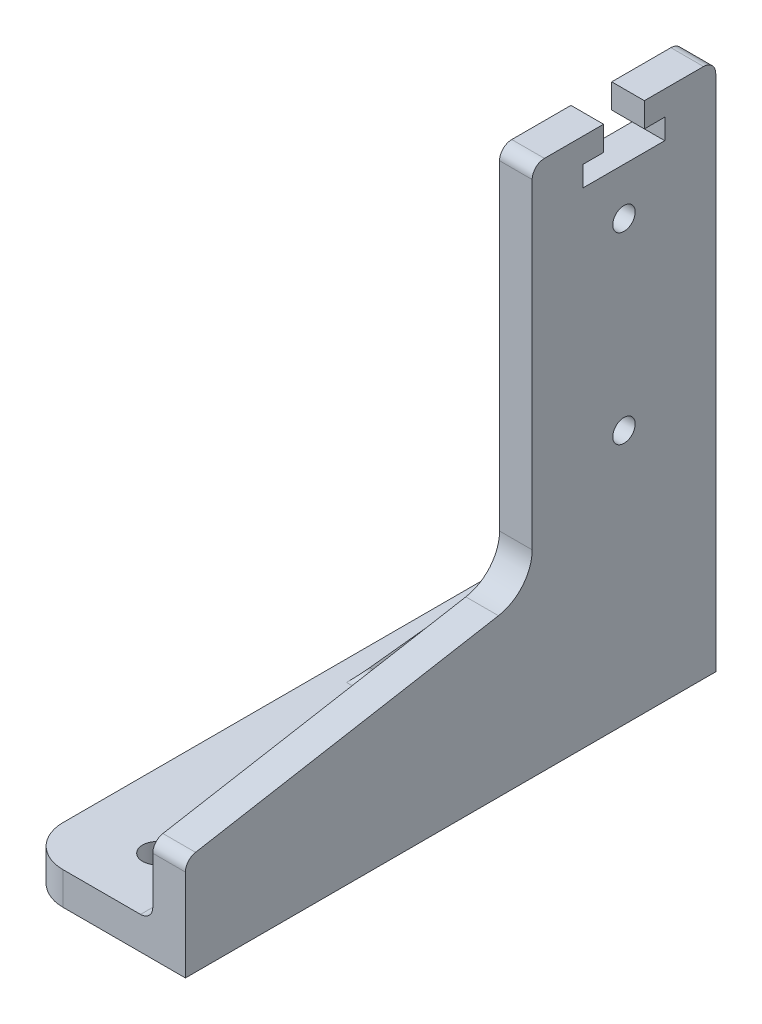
ISO-10303-21;
HEADER;
FILE_DESCRIPTION(('STEP AP214'),'2;1');
FILE_NAME('part.step','',(''),(''),'','','');
FILE_SCHEMA(('AUTOMOTIVE_DESIGN { 1 0 10303 214 1 1 1 1 }'));
ENDSEC;
DATA;
#1=APPLICATION_CONTEXT('core data for automotive mechanical design processes');
#2=APPLICATION_PROTOCOL_DEFINITION('international standard','automotive_design',2000,#1);
#3=PRODUCT_CONTEXT('',#1,'mechanical');
#4=PRODUCT('Part','Part','',(#3));
#5=PRODUCT_RELATED_PRODUCT_CATEGORY('part','',(#4));
#6=PRODUCT_DEFINITION_FORMATION('','',#4);
#7=PRODUCT_DEFINITION_CONTEXT('part definition',#1,'design');
#8=PRODUCT_DEFINITION('design','',#6,#7);
#9=PRODUCT_DEFINITION_SHAPE('','',#8);
#10=(LENGTH_UNIT() NAMED_UNIT(*) SI_UNIT(.MILLI.,.METRE.));
#11=(NAMED_UNIT(*) PLANE_ANGLE_UNIT() SI_UNIT($,.RADIAN.));
#12=(NAMED_UNIT(*) SI_UNIT($,.STERADIAN.) SOLID_ANGLE_UNIT());
#13=UNCERTAINTY_MEASURE_WITH_UNIT(LENGTH_MEASURE(1.E-05),#10,'distance_accuracy_value','');
#14=(GEOMETRIC_REPRESENTATION_CONTEXT(3) GLOBAL_UNCERTAINTY_ASSIGNED_CONTEXT((#13)) GLOBAL_UNIT_ASSIGNED_CONTEXT((#10,
#11,#12)) REPRESENTATION_CONTEXT('',''));
#15=CARTESIAN_POINT('',(0.,0.,0.));
#16=DIRECTION('',(0.,0.,1.));
#17=DIRECTION('',(1.,0.,0.));
#18=AXIS2_PLACEMENT_3D('',#15,#16,#17);
#19=CARTESIAN_POINT('',(0.,130.,65.));
#20=DIRECTION('',(0.,-1.,0.));
#21=DIRECTION('',(0.,0.,-1.));
#22=AXIS2_PLACEMENT_3D('',#19,#20,#21);
#23=PLANE('',#22);
#24=DIRECTION('',(0.,0.,-1.));
#25=VECTOR('',#24,1.);
#26=CARTESIAN_POINT('',(0.,130.,65.));
#27=LINE('',#26,#25);
#28=CARTESIAN_POINT('',(0.,130.,-47.5));
#29=VERTEX_POINT('',#28);
#30=CARTESIAN_POINT('',(0.,130.,-62.));
#31=VERTEX_POINT('',#30);
#32=EDGE_CURVE('E374',#29,#31,#27,.T.);
#33=ORIENTED_EDGE('',*,*,#32,.T.);
#34=DIRECTION('',(-1.,0.,0.));
#35=VECTOR('',#34,1.);
#36=CARTESIAN_POINT('',(0.,130.,-62.));
#37=LINE('',#36,#35);
#38=CARTESIAN_POINT('',(-8.,130.,-62.));
#39=VERTEX_POINT('',#38);
#40=EDGE_CURVE('E444',#31,#39,#37,.T.);
#41=ORIENTED_EDGE('',*,*,#40,.T.);
#42=DIRECTION('',(0.,0.,-1.));
#43=VECTOR('',#42,1.);
#44=CARTESIAN_POINT('',(-8.,130.,65.));
#45=LINE('',#44,#43);
#46=CARTESIAN_POINT('',(-8.,130.,-47.5));
#47=VERTEX_POINT('',#46);
#48=EDGE_CURVE('E371',#47,#39,#45,.T.);
#49=ORIENTED_EDGE('',*,*,#48,.F.);
#50=DIRECTION('',(-1.,0.,0.));
#51=VECTOR('',#50,1.);
#52=CARTESIAN_POINT('',(0.,130.,-47.5));
#53=LINE('',#52,#51);
#54=EDGE_CURVE('E310',#29,#47,#53,.T.);
#55=ORIENTED_EDGE('',*,*,#54,.F.);
#56=EDGE_LOOP('',(#33,#41,#49,#55));
#57=FACE_BOUND('',#56,.T.);
#58=ADVANCED_FACE('F41',(#57),#23,.F.);
#59=CARTESIAN_POINT('',(-40.,0.,65.));
#60=DIRECTION('',(0.,1.,0.));
#61=DIRECTION('',(0.,0.,1.));
#62=AXIS2_PLACEMENT_3D('',#59,#60,#61);
#63=PLANE('',#62);
#64=CARTESIAN_POINT('',(-22.,0.,50.));
#65=DIRECTION('',(0.,1.,0.));
#66=DIRECTION('',(-1.,0.,0.));
#67=AXIS2_PLACEMENT_3D('',#64,#65,#66);
#68=CIRCLE('',#67,3.5);
#69=CARTESIAN_POINT('',(-25.5,0.,50.));
#70=VERTEX_POINT('',#69);
#71=EDGE_CURVE('E321',#70,#70,#68,.T.);
#72=ORIENTED_EDGE('',*,*,#71,.T.);
#73=EDGE_LOOP('',(#72));
#74=FACE_BOUND('',#73,.T.);
#75=DIRECTION('',(0.,0.,-1.));
#76=VECTOR('',#75,1.);
#77=CARTESIAN_POINT('',(-40.,0.,65.));
#78=LINE('',#77,#76);
#79=CARTESIAN_POINT('',(-40.,0.,55.));
#80=VERTEX_POINT('',#79);
#81=CARTESIAN_POINT('',(-40.,0.,-55.));
#82=VERTEX_POINT('',#81);
#83=EDGE_CURVE('E358',#80,#82,#78,.T.);
#84=ORIENTED_EDGE('',*,*,#83,.T.);
#85=CARTESIAN_POINT('',(-30.,0.,-55.));
#86=DIRECTION('',(0.,1.,0.));
#87=DIRECTION('',(0.,0.,1.));
#88=AXIS2_PLACEMENT_3D('',#85,#86,#87);
#89=CIRCLE('',#88,10.);
#90=CARTESIAN_POINT('',(-30.,0.,-65.));
#91=VERTEX_POINT('',#90);
#92=EDGE_CURVE('E386',#82,#91,#89,.F.);
#93=ORIENTED_EDGE('',*,*,#92,.T.);
#94=DIRECTION('',(1.,0.,0.));
#95=VECTOR('',#94,1.);
#96=CARTESIAN_POINT('',(-40.,0.,-65.));
#97=LINE('',#96,#95);
#98=CARTESIAN_POINT('',(0.,0.,-65.));
#99=VERTEX_POINT('',#98);
#100=EDGE_CURVE('E339',#91,#99,#97,.T.);
#101=ORIENTED_EDGE('',*,*,#100,.T.);
#102=DIRECTION('',(0.,0.,-1.));
#103=VECTOR('',#102,1.);
#104=CARTESIAN_POINT('',(0.,0.,65.));
#105=LINE('',#104,#103);
#106=CARTESIAN_POINT('',(0.,0.,65.));
#107=VERTEX_POINT('',#106);
#108=EDGE_CURVE('E377',#107,#99,#105,.T.);
#109=ORIENTED_EDGE('',*,*,#108,.F.);
#110=DIRECTION('',(1.,0.,0.));
#111=VECTOR('',#110,1.);
#112=CARTESIAN_POINT('',(-40.,0.,65.));
#113=LINE('',#112,#111);
#114=CARTESIAN_POINT('',(-30.,0.,65.));
#115=VERTEX_POINT('',#114);
#116=EDGE_CURVE('E348',#115,#107,#113,.T.);
#117=ORIENTED_EDGE('',*,*,#116,.F.);
#118=CARTESIAN_POINT('',(-30.,0.,55.));
#119=DIRECTION('',(0.,1.,0.));
#120=DIRECTION('',(0.,0.,1.));
#121=AXIS2_PLACEMENT_3D('',#118,#119,#120);
#122=CIRCLE('',#121,10.);
#123=EDGE_CURVE('E384',#115,#80,#122,.F.);
#124=ORIENTED_EDGE('',*,*,#123,.T.);
#125=EDGE_LOOP('',(#84,#93,#101,#109,#117,#124));
#126=FACE_BOUND('',#125,.T.);
#127=CARTESIAN_POINT('',(-22.,0.,-50.));
#128=DIRECTION('',(0.,1.,0.));
#129=DIRECTION('',(-1.,0.,0.));
#130=AXIS2_PLACEMENT_3D('',#127,#128,#129);
#131=CIRCLE('',#130,3.5);
#132=CARTESIAN_POINT('',(-25.5,0.,-50.));
#133=VERTEX_POINT('',#132);
#134=EDGE_CURVE('E324',#133,#133,#131,.T.);
#135=ORIENTED_EDGE('',*,*,#134,.T.);
#136=EDGE_LOOP('',(#135));
#137=FACE_BOUND('',#136,.T.);
#138=ADVANCED_FACE('F623',(#74,#126,#137),#63,.F.);
#139=CARTESIAN_POINT('',(0.,0.,65.));
#140=DIRECTION('',(-1.,0.,0.));
#141=DIRECTION('',(0.,0.,1.));
#142=AXIS2_PLACEMENT_3D('',#139,#140,#141);
#143=PLANE('',#142);
#144=DIRECTION('',(0.,1.,0.));
#145=VECTOR('',#144,1.);
#146=CARTESIAN_POINT('',(0.,0.,-65.));
#147=LINE('',#146,#145);
#148=CARTESIAN_POINT('',(0.,127.,-65.));
#149=VERTEX_POINT('',#148);
#150=EDGE_CURVE('E361',#99,#149,#147,.T.);
#151=ORIENTED_EDGE('',*,*,#150,.T.);
#152=CARTESIAN_POINT('',(0.,127.,-62.));
#153=DIRECTION('',(-1.,0.,0.));
#154=DIRECTION('',(0.,0.,1.));
#155=AXIS2_PLACEMENT_3D('',#152,#153,#154);
#156=CIRCLE('',#155,3.);
#157=EDGE_CURVE('E452',#149,#31,#156,.F.);
#158=ORIENTED_EDGE('',*,*,#157,.T.);
#159=ORIENTED_EDGE('',*,*,#32,.F.);
#160=DIRECTION('',(0.,-1.,0.));
#161=VECTOR('',#160,1.);
#162=CARTESIAN_POINT('',(0.,130.,-47.5));
#163=LINE('',#162,#161);
#164=CARTESIAN_POINT('',(0.,124.,-47.5));
#165=VERTEX_POINT('',#164);
#166=EDGE_CURVE('E278',#29,#165,#163,.T.);
#167=ORIENTED_EDGE('',*,*,#166,.T.);
#168=DIRECTION('',(0.,0.,-1.));
#169=VECTOR('',#168,1.);
#170=CARTESIAN_POINT('',(0.,124.,-47.5));
#171=LINE('',#170,#169);
#172=CARTESIAN_POINT('',(0.,124.,-52.5));
#173=VERTEX_POINT('',#172);
#174=EDGE_CURVE('E281',#165,#173,#171,.T.);
#175=ORIENTED_EDGE('',*,*,#174,.T.);
#176=DIRECTION('',(0.,-1.,0.));
#177=VECTOR('',#176,1.);
#178=CARTESIAN_POINT('',(0.,124.,-52.5));
#179=LINE('',#178,#177);
#180=CARTESIAN_POINT('',(0.,119.,-52.5));
#181=VERTEX_POINT('',#180);
#182=EDGE_CURVE('E284',#173,#181,#179,.T.);
#183=ORIENTED_EDGE('',*,*,#182,.T.);
#184=DIRECTION('',(0.,0.,1.));
#185=VECTOR('',#184,1.);
#186=CARTESIAN_POINT('',(0.,119.,-52.5));
#187=LINE('',#186,#185);
#188=CARTESIAN_POINT('',(0.,119.,-32.5));
#189=VERTEX_POINT('',#188);
#190=EDGE_CURVE('E254',#181,#189,#187,.T.);
#191=ORIENTED_EDGE('',*,*,#190,.T.);
#192=DIRECTION('',(0.,1.,0.));
#193=VECTOR('',#192,1.);
#194=CARTESIAN_POINT('',(0.,124.,-32.5));
#195=LINE('',#194,#193);
#196=CARTESIAN_POINT('',(0.,124.,-32.5));
#197=VERTEX_POINT('',#196);
#198=EDGE_CURVE('E246',#189,#197,#195,.T.);
#199=ORIENTED_EDGE('',*,*,#198,.T.);
#200=DIRECTION('',(0.,0.,-1.));
#201=VECTOR('',#200,1.);
#202=CARTESIAN_POINT('',(0.,124.,-37.5));
#203=LINE('',#202,#201);
#204=CARTESIAN_POINT('',(0.,124.,-37.5));
#205=VERTEX_POINT('',#204);
#206=EDGE_CURVE('E257',#197,#205,#203,.T.);
#207=ORIENTED_EDGE('',*,*,#206,.T.);
#208=DIRECTION('',(0.,1.,0.));
#209=VECTOR('',#208,1.);
#210=CARTESIAN_POINT('',(0.,130.,-37.5));
#211=LINE('',#210,#209);
#212=CARTESIAN_POINT('',(0.,130.,-37.5));
#213=VERTEX_POINT('',#212);
#214=EDGE_CURVE('E261',#205,#213,#211,.T.);
#215=ORIENTED_EDGE('',*,*,#214,.T.);
#216=CARTESIAN_POINT('',(0.,130.,-23.));
#217=VERTEX_POINT('',#216);
#218=EDGE_CURVE('E375',#217,#213,#27,.T.);
#219=ORIENTED_EDGE('',*,*,#218,.F.);
#220=CARTESIAN_POINT('',(0.,127.,-23.));
#221=DIRECTION('',(-1.,0.,0.));
#222=DIRECTION('',(0.,0.,1.));
#223=AXIS2_PLACEMENT_3D('',#220,#221,#222);
#224=CIRCLE('',#223,3.);
#225=CARTESIAN_POINT('',(0.,127.,-20.));
#226=VERTEX_POINT('',#225);
#227=EDGE_CURVE('E449',#217,#226,#224,.F.);
#228=ORIENTED_EDGE('',*,*,#227,.T.);
#229=DIRECTION('',(0.,-1.,0.));
#230=VECTOR('',#229,1.);
#231=CARTESIAN_POINT('',(0.,40.,-20.));
#232=LINE('',#231,#230);
#233=CARTESIAN_POINT('',(0.,48.3898097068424,-20.));
#234=VERTEX_POINT('',#233);
#235=EDGE_CURVE('E316',#226,#234,#232,.T.);
#236=ORIENTED_EDGE('',*,*,#235,.T.);
#237=CARTESIAN_POINT('',(0.,48.3898097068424,-10.));
#238=DIRECTION('',(-1.,0.,0.));
#239=DIRECTION('',(0.,0.,1.));
#240=AXIS2_PLACEMENT_3D('',#237,#238,#239);
#241=CIRCLE('',#240,10.);
#242=CARTESIAN_POINT('',(0.,38.541974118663,-11.7378533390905));
#243=VERTEX_POINT('',#242);
#244=EDGE_CURVE('E408',#234,#243,#241,.T.);
#245=ORIENTED_EDGE('',*,*,#244,.T.);
#246=DIRECTION('',(0.,-0.173785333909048,0.984783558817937));
#247=VECTOR('',#246,1.);
#248=CARTESIAN_POINT('',(0.,25.,65.));
#249=LINE('',#248,#247);
#250=CARTESIAN_POINT('',(0.,25.4374077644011,62.5213560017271));
#251=VERTEX_POINT('',#250);
#252=EDGE_CURVE('E318',#243,#251,#249,.T.);
#253=ORIENTED_EDGE('',*,*,#252,.T.);
#254=CARTESIAN_POINT('',(0.,22.4830570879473,62.));
#255=DIRECTION('',(-1.,0.,0.));
#256=DIRECTION('',(0.,0.,1.));
#257=AXIS2_PLACEMENT_3D('',#254,#255,#256);
#258=CIRCLE('',#257,3.);
#259=CARTESIAN_POINT('',(0.,22.4830570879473,65.));
#260=VERTEX_POINT('',#259);
#261=EDGE_CURVE('E58',#251,#260,#258,.F.);
#262=ORIENTED_EDGE('',*,*,#261,.T.);
#263=DIRECTION('',(0.,1.,0.));
#264=VECTOR('',#263,1.);
#265=CARTESIAN_POINT('',(0.,0.,65.));
#266=LINE('',#265,#264);
#267=EDGE_CURVE('E350',#107,#260,#266,.T.);
#268=ORIENTED_EDGE('',*,*,#267,.F.);
#269=ORIENTED_EDGE('',*,*,#108,.T.);
#270=EDGE_LOOP('',(#151,#158,#159,#167,#175,#183,#191,#199,#207,#215,#219,#228,#236,#245,#253,
#262,#268,#269));
#271=FACE_BOUND('',#270,.T.);
#272=CARTESIAN_POINT('',(0.,62.5,-42.5));
#273=DIRECTION('',(-1.,0.,0.));
#274=DIRECTION('',(0.,-1.,0.));
#275=AXIS2_PLACEMENT_3D('',#272,#273,#274);
#276=CIRCLE('',#275,2.75);
#277=CARTESIAN_POINT('',(0.,59.75,-42.5));
#278=VERTEX_POINT('',#277);
#279=EDGE_CURVE('E327',#278,#278,#276,.T.);
#280=ORIENTED_EDGE('',*,*,#279,.T.);
#281=EDGE_LOOP('',(#280));
#282=FACE_BOUND('',#281,.T.);
#283=CARTESIAN_POINT('',(0.,107.5,-42.5));
#284=DIRECTION('',(-1.,0.,0.));
#285=DIRECTION('',(0.,-1.,0.));
#286=AXIS2_PLACEMENT_3D('',#283,#284,#285);
#287=CIRCLE('',#286,2.75);
#288=CARTESIAN_POINT('',(0.,104.75,-42.5));
#289=VERTEX_POINT('',#288);
#290=EDGE_CURVE('E336',#289,#289,#287,.T.);
#291=ORIENTED_EDGE('',*,*,#290,.T.);
#292=EDGE_LOOP('',(#291));
#293=FACE_BOUND('',#292,.T.);
#294=ADVANCED_FACE('F264',(#271,#282,#293),#143,.F.);
#295=CARTESIAN_POINT('',(-8.,130.,-23.));
#296=VERTEX_POINT('',#295);
#297=CARTESIAN_POINT('',(-8.,130.,-37.5));
#298=VERTEX_POINT('',#297);
#299=EDGE_CURVE('E372',#296,#298,#45,.T.);
#300=ORIENTED_EDGE('',*,*,#299,.F.);
#301=DIRECTION('',(-1.,0.,0.));
#302=VECTOR('',#301,1.);
#303=CARTESIAN_POINT('',(0.,130.,-23.));
#304=LINE('',#303,#302);
#305=EDGE_CURVE('E461',#296,#217,#304,.F.);
#306=ORIENTED_EDGE('',*,*,#305,.T.);
#307=ORIENTED_EDGE('',*,*,#218,.T.);
#308=DIRECTION('',(-1.,0.,0.));
#309=VECTOR('',#308,1.);
#310=CARTESIAN_POINT('',(0.,130.,-37.5));
#311=LINE('',#310,#309);
#312=EDGE_CURVE('E312',#213,#298,#311,.T.);
#313=ORIENTED_EDGE('',*,*,#312,.T.);
#314=EDGE_LOOP('',(#300,#306,#307,#313));
#315=FACE_BOUND('',#314,.T.);
#316=ADVANCED_FACE('F591',(#315),#23,.F.);
#317=CARTESIAN_POINT('',(-8.,130.,65.));
#318=DIRECTION('',(1.,0.,0.));
#319=DIRECTION('',(0.,1.,0.));
#320=AXIS2_PLACEMENT_3D('',#317,#318,#319);
#321=PLANE('',#320);
#322=CARTESIAN_POINT('',(-8.,107.5,-42.5));
#323=DIRECTION('',(-1.,0.,0.));
#324=DIRECTION('',(0.,-1.,0.));
#325=AXIS2_PLACEMENT_3D('',#322,#323,#324);
#326=CIRCLE('',#325,2.75);
#327=CARTESIAN_POINT('',(-8.,104.75,-42.5));
#328=VERTEX_POINT('',#327);
#329=EDGE_CURVE('E340',#328,#328,#326,.T.);
#330=ORIENTED_EDGE('',*,*,#329,.F.);
#331=EDGE_LOOP('',(#330));
#332=FACE_BOUND('',#331,.T.);
#333=CARTESIAN_POINT('',(-7.99999999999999,62.5,-42.5));
#334=DIRECTION('',(-1.,0.,0.));
#335=DIRECTION('',(0.,-1.,0.));
#336=AXIS2_PLACEMENT_3D('',#333,#334,#335);
#337=CIRCLE('',#336,2.75);
#338=CARTESIAN_POINT('',(-7.99999999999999,59.75,-42.5));
#339=VERTEX_POINT('',#338);
#340=EDGE_CURVE('E343',#339,#339,#337,.T.);
#341=ORIENTED_EDGE('',*,*,#340,.F.);
#342=EDGE_LOOP('',(#341));
#343=FACE_BOUND('',#342,.T.);
#344=DIRECTION('',(0.,-1.,0.));
#345=VECTOR('',#344,1.);
#346=CARTESIAN_POINT('',(-7.99999999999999,38.,-20.5));
#347=LINE('',#346,#345);
#348=CARTESIAN_POINT('',(-7.99999999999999,11.,-20.5));
#349=VERTEX_POINT('',#348);
#350=CARTESIAN_POINT('',(-7.99999999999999,38.,-20.5));
#351=VERTEX_POINT('',#350);
#352=EDGE_CURVE('E423',#349,#351,#347,.F.);
#353=ORIENTED_EDGE('',*,*,#352,.T.);
#354=DIRECTION('',(0.,0.,-1.));
#355=VECTOR('',#354,1.);
#356=CARTESIAN_POINT('',(-7.99999999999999,38.,65.));
#357=LINE('',#356,#355);
#358=CARTESIAN_POINT('',(-7.99999999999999,38.,-9.49999999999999));
#359=VERTEX_POINT('',#358);
#360=EDGE_CURVE('E274',#351,#359,#357,.F.);
#361=ORIENTED_EDGE('',*,*,#360,.T.);
#362=DIRECTION('',(0.,-1.,0.));
#363=VECTOR('',#362,1.);
#364=CARTESIAN_POINT('',(-8.,130.,-9.49999999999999));
#365=LINE('',#364,#363);
#366=CARTESIAN_POINT('',(-7.99999999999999,11.,-9.49999999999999));
#367=VERTEX_POINT('',#366);
#368=EDGE_CURVE('E418',#359,#367,#365,.T.);
#369=ORIENTED_EDGE('',*,*,#368,.T.);
#370=DIRECTION('',(0.,0.,-1.));
#371=VECTOR('',#370,1.);
#372=CARTESIAN_POINT('',(-7.99999999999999,11.,65.));
#373=LINE('',#372,#371);
#374=CARTESIAN_POINT('',(-7.99999999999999,11.,65.));
#375=VERTEX_POINT('',#374);
#376=EDGE_CURVE('E416',#367,#375,#373,.F.);
#377=ORIENTED_EDGE('',*,*,#376,.T.);
#378=DIRECTION('',(0.,-1.,0.));
#379=VECTOR('',#378,1.);
#380=CARTESIAN_POINT('',(-8.,130.,65.));
#381=LINE('',#380,#379);
#382=CARTESIAN_POINT('',(-7.99999999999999,22.4830570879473,65.));
#383=VERTEX_POINT('',#382);
#384=EDGE_CURVE('E353',#383,#375,#381,.T.);
#385=ORIENTED_EDGE('',*,*,#384,.F.);
#386=CARTESIAN_POINT('',(-7.99999999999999,22.4830570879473,62.));
#387=DIRECTION('',(1.,0.,0.));
#388=DIRECTION('',(0.,1.,0.));
#389=AXIS2_PLACEMENT_3D('',#386,#387,#388);
#390=CIRCLE('',#389,3.);
#391=CARTESIAN_POINT('',(-7.99999999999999,25.4374077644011,62.5213560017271));
#392=VERTEX_POINT('',#391);
#393=EDGE_CURVE('E412',#383,#392,#390,.F.);
#394=ORIENTED_EDGE('',*,*,#393,.T.);
#395=DIRECTION('',(0.,-0.173785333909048,0.984783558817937));
#396=VECTOR('',#395,1.);
#397=CARTESIAN_POINT('',(-7.99999999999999,25.,65.));
#398=LINE('',#397,#396);
#399=CARTESIAN_POINT('',(-7.99999999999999,38.541974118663,-11.7378533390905));
#400=VERTEX_POINT('',#399);
#401=EDGE_CURVE('E319',#400,#392,#398,.T.);
#402=ORIENTED_EDGE('',*,*,#401,.F.);
#403=CARTESIAN_POINT('',(-7.99999999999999,48.3898097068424,-10.));
#404=DIRECTION('',(1.,0.,0.));
#405=DIRECTION('',(0.,1.,0.));
#406=AXIS2_PLACEMENT_3D('',#403,#404,#405);
#407=CIRCLE('',#406,10.);
#408=CARTESIAN_POINT('',(-7.99999999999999,48.3898097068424,-20.));
#409=VERTEX_POINT('',#408);
#410=EDGE_CURVE('E405',#400,#409,#407,.T.);
#411=ORIENTED_EDGE('',*,*,#410,.T.);
#412=DIRECTION('',(0.,-1.,0.));
#413=VECTOR('',#412,1.);
#414=CARTESIAN_POINT('',(-7.99999999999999,40.,-20.));
#415=LINE('',#414,#413);
#416=CARTESIAN_POINT('',(-8.,127.,-20.));
#417=VERTEX_POINT('',#416);
#418=EDGE_CURVE('E303',#417,#409,#415,.T.);
#419=ORIENTED_EDGE('',*,*,#418,.F.);
#420=CARTESIAN_POINT('',(-8.,127.,-23.));
#421=DIRECTION('',(1.,0.,0.));
#422=DIRECTION('',(0.,1.,0.));
#423=AXIS2_PLACEMENT_3D('',#420,#421,#422);
#424=CIRCLE('',#423,3.);
#425=EDGE_CURVE('E410',#417,#296,#424,.F.);
#426=ORIENTED_EDGE('',*,*,#425,.T.);
#427=ORIENTED_EDGE('',*,*,#299,.T.);
#428=DIRECTION('',(0.,1.,0.));
#429=VECTOR('',#428,1.);
#430=CARTESIAN_POINT('',(-8.,130.,-37.5));
#431=LINE('',#430,#429);
#432=CARTESIAN_POINT('',(-8.,124.,-37.5));
#433=VERTEX_POINT('',#432);
#434=EDGE_CURVE('E290',#433,#298,#431,.T.);
#435=ORIENTED_EDGE('',*,*,#434,.F.);
#436=DIRECTION('',(0.,0.,-1.));
#437=VECTOR('',#436,1.);
#438=CARTESIAN_POINT('',(-8.,124.,-37.5));
#439=LINE('',#438,#437);
#440=CARTESIAN_POINT('',(-8.,124.,-32.5));
#441=VERTEX_POINT('',#440);
#442=EDGE_CURVE('E288',#441,#433,#439,.T.);
#443=ORIENTED_EDGE('',*,*,#442,.F.);
#444=DIRECTION('',(0.,1.,0.));
#445=VECTOR('',#444,1.);
#446=CARTESIAN_POINT('',(-8.,124.,-32.5));
#447=LINE('',#446,#445);
#448=CARTESIAN_POINT('',(-8.,119.,-32.5));
#449=VERTEX_POINT('',#448);
#450=EDGE_CURVE('E249',#449,#441,#447,.T.);
#451=ORIENTED_EDGE('',*,*,#450,.F.);
#452=DIRECTION('',(0.,0.,1.));
#453=VECTOR('',#452,1.);
#454=CARTESIAN_POINT('',(-8.,119.,-52.5));
#455=LINE('',#454,#453);
#456=CARTESIAN_POINT('',(-8.,119.,-52.5));
#457=VERTEX_POINT('',#456);
#458=EDGE_CURVE('E268',#457,#449,#455,.T.);
#459=ORIENTED_EDGE('',*,*,#458,.F.);
#460=DIRECTION('',(0.,-1.,0.));
#461=VECTOR('',#460,1.);
#462=CARTESIAN_POINT('',(-8.,124.,-52.5));
#463=LINE('',#462,#461);
#464=CARTESIAN_POINT('',(-8.,124.,-52.5));
#465=VERTEX_POINT('',#464);
#466=EDGE_CURVE('E271',#465,#457,#463,.T.);
#467=ORIENTED_EDGE('',*,*,#466,.F.);
#468=DIRECTION('',(0.,0.,-1.));
#469=VECTOR('',#468,1.);
#470=CARTESIAN_POINT('',(-8.,124.,-47.5));
#471=LINE('',#470,#469);
#472=CARTESIAN_POINT('',(-8.,124.,-47.5));
#473=VERTEX_POINT('',#472);
#474=EDGE_CURVE('E296',#473,#465,#471,.T.);
#475=ORIENTED_EDGE('',*,*,#474,.F.);
#476=DIRECTION('',(0.,-1.,0.));
#477=VECTOR('',#476,1.);
#478=CARTESIAN_POINT('',(-8.,130.,-47.5));
#479=LINE('',#478,#477);
#480=EDGE_CURVE('E293',#47,#473,#479,.T.);
#481=ORIENTED_EDGE('',*,*,#480,.F.);
#482=ORIENTED_EDGE('',*,*,#48,.T.);
#483=CARTESIAN_POINT('',(-8.,127.,-62.));
#484=DIRECTION('',(1.,0.,0.));
#485=DIRECTION('',(0.,1.,0.));
#486=AXIS2_PLACEMENT_3D('',#483,#484,#485);
#487=CIRCLE('',#486,3.);
#488=CARTESIAN_POINT('',(-8.,127.,-65.));
#489=VERTEX_POINT('',#488);
#490=EDGE_CURVE('E414',#39,#489,#487,.F.);
#491=ORIENTED_EDGE('',*,*,#490,.T.);
#492=DIRECTION('',(0.,-1.,0.));
#493=VECTOR('',#492,1.);
#494=CARTESIAN_POINT('',(-8.,130.,-65.));
#495=LINE('',#494,#493);
#496=CARTESIAN_POINT('',(-7.99999999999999,11.,-65.));
#497=VERTEX_POINT('',#496);
#498=EDGE_CURVE('E363',#489,#497,#495,.T.);
#499=ORIENTED_EDGE('',*,*,#498,.T.);
#500=DIRECTION('',(0.,0.,-1.));
#501=VECTOR('',#500,1.);
#502=CARTESIAN_POINT('',(-7.99999999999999,11.,-17.5));
#503=LINE('',#502,#501);
#504=EDGE_CURVE('E421',#497,#349,#503,.F.);
#505=ORIENTED_EDGE('',*,*,#504,.T.);
#506=EDGE_LOOP('',(#353,#361,#369,#377,#385,#394,#402,#411,#419,#426,#427,#435,#443,#451,#459,
#467,#475,#481,#482,#491,#499,#505));
#507=FACE_BOUND('',#506,.T.);
#508=ADVANCED_FACE('F507',(#332,#343,#507),#321,.F.);
#509=CARTESIAN_POINT('',(-7.99999999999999,8.,65.));
#510=DIRECTION('',(0.,-1.,0.));
#511=DIRECTION('',(1.,0.,0.));
#512=AXIS2_PLACEMENT_3D('',#509,#510,#511);
#513=PLANE('',#512);
#514=CARTESIAN_POINT('',(-22.,8.,-50.));
#515=DIRECTION('',(0.,1.,0.));
#516=DIRECTION('',(-1.,0.,0.));
#517=AXIS2_PLACEMENT_3D('',#514,#515,#516);
#518=CIRCLE('',#517,3.5);
#519=CARTESIAN_POINT('',(-25.5,8.,-50.));
#520=VERTEX_POINT('',#519);
#521=EDGE_CURVE('E328',#520,#520,#518,.T.);
#522=ORIENTED_EDGE('',*,*,#521,.F.);
#523=EDGE_LOOP('',(#522));
#524=FACE_BOUND('',#523,.T.);
#525=CARTESIAN_POINT('',(-22.,8.,50.));
#526=DIRECTION('',(0.,1.,0.));
#527=DIRECTION('',(-1.,0.,0.));
#528=AXIS2_PLACEMENT_3D('',#525,#526,#527);
#529=CIRCLE('',#528,3.5);
#530=CARTESIAN_POINT('',(-25.5,8.,50.));
#531=VERTEX_POINT('',#530);
#532=EDGE_CURVE('E331',#531,#531,#529,.T.);
#533=ORIENTED_EDGE('',*,*,#532,.F.);
#534=EDGE_LOOP('',(#533));
#535=FACE_BOUND('',#534,.T.);
#536=DIRECTION('',(0.,0.,1.));
#537=VECTOR('',#536,1.);
#538=CARTESIAN_POINT('',(-35.,8.,65.));
#539=LINE('',#538,#537);
#540=CARTESIAN_POINT('',(-35.,8.,-9.49999999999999));
#541=VERTEX_POINT('',#540);
#542=CARTESIAN_POINT('',(-35.,8.,-20.5));
#543=VERTEX_POINT('',#542);
#544=EDGE_CURVE('E565',#541,#543,#539,.F.);
#545=ORIENTED_EDGE('',*,*,#544,.T.);
#546=DIRECTION('',(-1.,0.,0.));
#547=VECTOR('',#546,1.);
#548=CARTESIAN_POINT('',(-7.99999999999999,8.,-20.5));
#549=LINE('',#548,#547);
#550=CARTESIAN_POINT('',(-11.,8.,-20.5));
#551=VERTEX_POINT('',#550);
#552=EDGE_CURVE('E442',#543,#551,#549,.F.);
#553=ORIENTED_EDGE('',*,*,#552,.T.);
#554=DIRECTION('',(0.,0.,-1.));
#555=VECTOR('',#554,1.);
#556=CARTESIAN_POINT('',(-11.,8.,-65.));
#557=LINE('',#556,#555);
#558=CARTESIAN_POINT('',(-11.,8.,-65.));
#559=VERTEX_POINT('',#558);
#560=EDGE_CURVE('E440',#551,#559,#557,.T.);
#561=ORIENTED_EDGE('',*,*,#560,.T.);
#562=DIRECTION('',(-1.,0.,0.));
#563=VECTOR('',#562,1.);
#564=CARTESIAN_POINT('',(-7.99999999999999,8.,-65.));
#565=LINE('',#564,#563);
#566=CARTESIAN_POINT('',(-30.,8.,-65.));
#567=VERTEX_POINT('',#566);
#568=EDGE_CURVE('E351',#559,#567,#565,.T.);
#569=ORIENTED_EDGE('',*,*,#568,.T.);
#570=CARTESIAN_POINT('',(-30.,8.,-55.));
#571=DIRECTION('',(0.,-1.,0.));
#572=DIRECTION('',(1.,0.,0.));
#573=AXIS2_PLACEMENT_3D('',#570,#571,#572);
#574=CIRCLE('',#573,10.);
#575=CARTESIAN_POINT('',(-40.,8.,-55.));
#576=VERTEX_POINT('',#575);
#577=EDGE_CURVE('E394',#567,#576,#574,.F.);
#578=ORIENTED_EDGE('',*,*,#577,.T.);
#579=DIRECTION('',(0.,0.,-1.));
#580=VECTOR('',#579,1.);
#581=CARTESIAN_POINT('',(-40.,8.,65.));
#582=LINE('',#581,#580);
#583=CARTESIAN_POINT('',(-40.,8.,55.));
#584=VERTEX_POINT('',#583);
#585=EDGE_CURVE('E368',#584,#576,#582,.T.);
#586=ORIENTED_EDGE('',*,*,#585,.F.);
#587=CARTESIAN_POINT('',(-30.,8.,55.));
#588=DIRECTION('',(0.,-1.,0.));
#589=DIRECTION('',(1.,0.,0.));
#590=AXIS2_PLACEMENT_3D('',#587,#588,#589);
#591=CIRCLE('',#590,10.);
#592=CARTESIAN_POINT('',(-30.,8.,65.));
#593=VERTEX_POINT('',#592);
#594=EDGE_CURVE('E391',#584,#593,#591,.F.);
#595=ORIENTED_EDGE('',*,*,#594,.T.);
#596=DIRECTION('',(-1.,0.,0.));
#597=VECTOR('',#596,1.);
#598=CARTESIAN_POINT('',(-7.99999999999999,8.,65.));
#599=LINE('',#598,#597);
#600=CARTESIAN_POINT('',(-11.,8.,65.));
#601=VERTEX_POINT('',#600);
#602=EDGE_CURVE('E356',#601,#593,#599,.T.);
#603=ORIENTED_EDGE('',*,*,#602,.F.);
#604=DIRECTION('',(0.,0.,-1.));
#605=VECTOR('',#604,1.);
#606=CARTESIAN_POINT('',(-11.,8.,-12.5));
#607=LINE('',#606,#605);
#608=CARTESIAN_POINT('',(-11.,8.,-9.49999999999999));
#609=VERTEX_POINT('',#608);
#610=EDGE_CURVE('E435',#601,#609,#607,.T.);
#611=ORIENTED_EDGE('',*,*,#610,.T.);
#612=DIRECTION('',(-1.,0.,0.));
#613=VECTOR('',#612,1.);
#614=CARTESIAN_POINT('',(-7.99999999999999,8.,-9.49999999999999));
#615=LINE('',#614,#613);
#616=EDGE_CURVE('E437',#609,#541,#615,.T.);
#617=ORIENTED_EDGE('',*,*,#616,.T.);
#618=EDGE_LOOP('',(#545,#553,#561,#569,#578,#586,#595,#603,#611,#617));
#619=FACE_BOUND('',#618,.T.);
#620=ADVANCED_FACE('F516',(#524,#535,#619),#513,.F.);
#621=CARTESIAN_POINT('',(-40.,8.,65.));
#622=DIRECTION('',(1.,0.,0.));
#623=DIRECTION('',(0.,0.,-1.));
#624=AXIS2_PLACEMENT_3D('',#621,#622,#623);
#625=PLANE('',#624);
#626=DIRECTION('',(0.,-1.,0.));
#627=VECTOR('',#626,1.);
#628=CARTESIAN_POINT('',(-40.,8.,-55.));
#629=LINE('',#628,#627);
#630=EDGE_CURVE('E381',#576,#82,#629,.T.);
#631=ORIENTED_EDGE('',*,*,#630,.T.);
#632=ORIENTED_EDGE('',*,*,#83,.F.);
#633=DIRECTION('',(0.,-1.,0.));
#634=VECTOR('',#633,1.);
#635=CARTESIAN_POINT('',(-40.,8.,55.));
#636=LINE('',#635,#634);
#637=EDGE_CURVE('E379',#80,#584,#636,.F.);
#638=ORIENTED_EDGE('',*,*,#637,.T.);
#639=ORIENTED_EDGE('',*,*,#585,.T.);
#640=EDGE_LOOP('',(#631,#632,#638,#639));
#641=FACE_BOUND('',#640,.T.);
#642=ADVANCED_FACE('F530',(#641),#625,.F.);
#643=CARTESIAN_POINT('',(0.,0.,65.));
#644=DIRECTION('',(0.,0.,1.));
#645=DIRECTION('',(1.,0.,0.));
#646=AXIS2_PLACEMENT_3D('',#643,#644,#645);
#647=PLANE('',#646);
#648=ORIENTED_EDGE('',*,*,#267,.T.);
#649=DIRECTION('',(-1.,0.,0.));
#650=VECTOR('',#649,1.);
#651=CARTESIAN_POINT('',(-7.99999999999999,22.4830570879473,65.));
#652=LINE('',#651,#650);
#653=EDGE_CURVE('E454',#260,#383,#652,.T.);
#654=ORIENTED_EDGE('',*,*,#653,.T.);
#655=ORIENTED_EDGE('',*,*,#384,.T.);
#656=CARTESIAN_POINT('',(-11.,11.,65.));
#657=DIRECTION('',(0.,0.,1.));
#658=DIRECTION('',(1.,0.,0.));
#659=AXIS2_PLACEMENT_3D('',#656,#657,#658);
#660=CIRCLE('',#659,3.);
#661=EDGE_CURVE('E11',#375,#601,#660,.F.);
#662=ORIENTED_EDGE('',*,*,#661,.T.);
#663=ORIENTED_EDGE('',*,*,#602,.T.);
#664=DIRECTION('',(0.,-1.,0.));
#665=VECTOR('',#664,1.);
#666=CARTESIAN_POINT('',(-30.,0.,65.));
#667=LINE('',#666,#665);
#668=EDGE_CURVE('E396',#593,#115,#667,.T.);
#669=ORIENTED_EDGE('',*,*,#668,.T.);
#670=ORIENTED_EDGE('',*,*,#116,.T.);
#671=EDGE_LOOP('',(#648,#654,#655,#662,#663,#669,#670));
#672=FACE_BOUND('',#671,.T.);
#673=ADVANCED_FACE('F569',(#672),#647,.T.);
#674=CARTESIAN_POINT('',(0.,0.,-65.));
#675=DIRECTION('',(0.,0.,1.));
#676=DIRECTION('',(1.,0.,0.));
#677=AXIS2_PLACEMENT_3D('',#674,#675,#676);
#678=PLANE('',#677);
#679=ORIENTED_EDGE('',*,*,#498,.F.);
#680=DIRECTION('',(-1.,0.,0.));
#681=VECTOR('',#680,1.);
#682=CARTESIAN_POINT('',(0.,127.,-65.));
#683=LINE('',#682,#681);
#684=EDGE_CURVE('E447',#489,#149,#683,.F.);
#685=ORIENTED_EDGE('',*,*,#684,.T.);
#686=ORIENTED_EDGE('',*,*,#150,.F.);
#687=ORIENTED_EDGE('',*,*,#100,.F.);
#688=DIRECTION('',(0.,-1.,0.));
#689=VECTOR('',#688,1.);
#690=CARTESIAN_POINT('',(-30.,0.,-65.));
#691=LINE('',#690,#689);
#692=EDGE_CURVE('E388',#91,#567,#691,.F.);
#693=ORIENTED_EDGE('',*,*,#692,.T.);
#694=ORIENTED_EDGE('',*,*,#568,.F.);
#695=CARTESIAN_POINT('',(-11.,11.,-65.));
#696=DIRECTION('',(0.,0.,1.));
#697=DIRECTION('',(1.,0.,0.));
#698=AXIS2_PLACEMENT_3D('',#695,#696,#697);
#699=CIRCLE('',#698,3.);
#700=EDGE_CURVE('E50',#559,#497,#699,.T.);
#701=ORIENTED_EDGE('',*,*,#700,.T.);
#702=EDGE_LOOP('',(#679,#685,#686,#687,#693,#694,#701));
#703=FACE_BOUND('',#702,.T.);
#704=ADVANCED_FACE('F518',(#703),#678,.F.);
#705=CARTESIAN_POINT('',(0.,62.5,-42.5));
#706=DIRECTION('',(-1.,0.,0.));
#707=DIRECTION('',(0.,-1.,0.));
#708=AXIS2_PLACEMENT_3D('',#705,#706,#707);
#709=CYLINDRICAL_SURFACE('',#708,2.75);
#710=ORIENTED_EDGE('',*,*,#279,.F.);
#711=EDGE_LOOP('',(#710));
#712=FACE_BOUND('',#711,.T.);
#713=ORIENTED_EDGE('',*,*,#340,.T.);
#714=EDGE_LOOP('',(#713));
#715=FACE_BOUND('',#714,.T.);
#716=ADVANCED_FACE('F649',(#712,#715),#709,.F.);
#717=CARTESIAN_POINT('',(0.,107.5,-42.5));
#718=DIRECTION('',(-1.,0.,0.));
#719=DIRECTION('',(0.,-1.,0.));
#720=AXIS2_PLACEMENT_3D('',#717,#718,#719);
#721=CYLINDRICAL_SURFACE('',#720,2.75);
#722=ORIENTED_EDGE('',*,*,#290,.F.);
#723=EDGE_LOOP('',(#722));
#724=FACE_BOUND('',#723,.T.);
#725=ORIENTED_EDGE('',*,*,#329,.T.);
#726=EDGE_LOOP('',(#725));
#727=FACE_BOUND('',#726,.T.);
#728=ADVANCED_FACE('F643',(#724,#727),#721,.F.);
#729=CARTESIAN_POINT('',(-22.,0.,50.));
#730=DIRECTION('',(0.,1.,0.));
#731=DIRECTION('',(-1.,0.,0.));
#732=AXIS2_PLACEMENT_3D('',#729,#730,#731);
#733=CYLINDRICAL_SURFACE('',#732,3.5);
#734=ORIENTED_EDGE('',*,*,#71,.F.);
#735=EDGE_LOOP('',(#734));
#736=FACE_BOUND('',#735,.T.);
#737=ORIENTED_EDGE('',*,*,#532,.T.);
#738=EDGE_LOOP('',(#737));
#739=FACE_BOUND('',#738,.T.);
#740=ADVANCED_FACE('F633',(#736,#739),#733,.F.);
#741=CARTESIAN_POINT('',(-22.,0.,-50.));
#742=DIRECTION('',(0.,1.,0.));
#743=DIRECTION('',(-1.,0.,0.));
#744=AXIS2_PLACEMENT_3D('',#741,#742,#743);
#745=CYLINDRICAL_SURFACE('',#744,3.5);
#746=ORIENTED_EDGE('',*,*,#134,.F.);
#747=EDGE_LOOP('',(#746));
#748=FACE_BOUND('',#747,.T.);
#749=ORIENTED_EDGE('',*,*,#521,.T.);
#750=EDGE_LOOP('',(#749));
#751=FACE_BOUND('',#750,.T.);
#752=ADVANCED_FACE('F630',(#748,#751),#745,.F.);
#753=CARTESIAN_POINT('',(0.,40.,-20.));
#754=DIRECTION('',(0.,0.,-1.));
#755=DIRECTION('',(-1.,0.,0.));
#756=AXIS2_PLACEMENT_3D('',#753,#754,#755);
#757=PLANE('',#756);
#758=ORIENTED_EDGE('',*,*,#235,.F.);
#759=DIRECTION('',(-1.,0.,0.));
#760=VECTOR('',#759,1.);
#761=CARTESIAN_POINT('',(0.,127.,-20.));
#762=LINE('',#761,#760);
#763=EDGE_CURVE('E458',#226,#417,#762,.T.);
#764=ORIENTED_EDGE('',*,*,#763,.T.);
#765=ORIENTED_EDGE('',*,*,#418,.T.);
#766=DIRECTION('',(-1.,0.,0.));
#767=VECTOR('',#766,1.);
#768=CARTESIAN_POINT('',(0.,48.3898097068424,-20.));
#769=LINE('',#768,#767);
#770=EDGE_CURVE('E402',#409,#234,#769,.F.);
#771=ORIENTED_EDGE('',*,*,#770,.T.);
#772=EDGE_LOOP('',(#758,#764,#765,#771));
#773=FACE_BOUND('',#772,.T.);
#774=ADVANCED_FACE('F584',(#773),#757,.F.);
#775=CARTESIAN_POINT('',(0.,25.,65.));
#776=DIRECTION('',(0.,-0.984783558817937,-0.173785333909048));
#777=DIRECTION('',(0.,0.173785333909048,-0.984783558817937));
#778=AXIS2_PLACEMENT_3D('',#775,#776,#777);
#779=PLANE('',#778);
#780=ORIENTED_EDGE('',*,*,#401,.T.);
#781=DIRECTION('',(-1.,0.,0.));
#782=VECTOR('',#781,1.);
#783=CARTESIAN_POINT('',(0.,25.4374077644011,62.5213560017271));
#784=LINE('',#783,#782);
#785=EDGE_CURVE('E66',#392,#251,#784,.F.);
#786=ORIENTED_EDGE('',*,*,#785,.T.);
#787=ORIENTED_EDGE('',*,*,#252,.F.);
#788=DIRECTION('',(-1.,0.,0.));
#789=VECTOR('',#788,1.);
#790=CARTESIAN_POINT('',(-7.99999999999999,38.541974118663,-11.7378533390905));
#791=LINE('',#790,#789);
#792=EDGE_CURVE('E399',#243,#400,#791,.T.);
#793=ORIENTED_EDGE('',*,*,#792,.T.);
#794=EDGE_LOOP('',(#780,#786,#787,#793));
#795=FACE_BOUND('',#794,.T.);
#796=ADVANCED_FACE('F574',(#795),#779,.F.);
#797=CARTESIAN_POINT('',(0.,124.,-32.5));
#798=DIRECTION('',(0.,0.,1.));
#799=DIRECTION('',(1.,0.,0.));
#800=AXIS2_PLACEMENT_3D('',#797,#798,#799);
#801=PLANE('',#800);
#802=ORIENTED_EDGE('',*,*,#450,.T.);
#803=DIRECTION('',(-1.,0.,0.));
#804=VECTOR('',#803,1.);
#805=CARTESIAN_POINT('',(0.,124.,-32.5));
#806=LINE('',#805,#804);
#807=EDGE_CURVE('E242',#197,#441,#806,.T.);
#808=ORIENTED_EDGE('',*,*,#807,.F.);
#809=ORIENTED_EDGE('',*,*,#198,.F.);
#810=DIRECTION('',(-1.,0.,0.));
#811=VECTOR('',#810,1.);
#812=CARTESIAN_POINT('',(0.,119.,-32.5));
#813=LINE('',#812,#811);
#814=EDGE_CURVE('E301',#189,#449,#813,.T.);
#815=ORIENTED_EDGE('',*,*,#814,.T.);
#816=EDGE_LOOP('',(#802,#808,#809,#815));
#817=FACE_BOUND('',#816,.T.);
#818=ADVANCED_FACE('F244',(#817),#801,.F.);
#819=CARTESIAN_POINT('',(0.,119.,-52.5));
#820=DIRECTION('',(0.,-1.,0.));
#821=DIRECTION('',(1.,0.,0.));
#822=AXIS2_PLACEMENT_3D('',#819,#820,#821);
#823=PLANE('',#822);
#824=ORIENTED_EDGE('',*,*,#458,.T.);
#825=ORIENTED_EDGE('',*,*,#814,.F.);
#826=ORIENTED_EDGE('',*,*,#190,.F.);
#827=DIRECTION('',(-1.,0.,0.));
#828=VECTOR('',#827,1.);
#829=CARTESIAN_POINT('',(0.,119.,-52.5));
#830=LINE('',#829,#828);
#831=EDGE_CURVE('E304',#181,#457,#830,.T.);
#832=ORIENTED_EDGE('',*,*,#831,.T.);
#833=EDGE_LOOP('',(#824,#825,#826,#832));
#834=FACE_BOUND('',#833,.T.);
#835=ADVANCED_FACE('F600',(#834),#823,.F.);
#836=CARTESIAN_POINT('',(0.,124.,-52.5));
#837=DIRECTION('',(0.,0.,-1.));
#838=DIRECTION('',(-1.,0.,0.));
#839=AXIS2_PLACEMENT_3D('',#836,#837,#838);
#840=PLANE('',#839);
#841=ORIENTED_EDGE('',*,*,#466,.T.);
#842=ORIENTED_EDGE('',*,*,#831,.F.);
#843=ORIENTED_EDGE('',*,*,#182,.F.);
#844=DIRECTION('',(-1.,0.,0.));
#845=VECTOR('',#844,1.);
#846=CARTESIAN_POINT('',(0.,124.,-52.5));
#847=LINE('',#846,#845);
#848=EDGE_CURVE('E306',#173,#465,#847,.T.);
#849=ORIENTED_EDGE('',*,*,#848,.T.);
#850=EDGE_LOOP('',(#841,#842,#843,#849));
#851=FACE_BOUND('',#850,.T.);
#852=ADVANCED_FACE('F603',(#851),#840,.F.);
#853=CARTESIAN_POINT('',(0.,124.,-47.5));
#854=DIRECTION('',(0.,1.,0.));
#855=DIRECTION('',(-1.,0.,0.));
#856=AXIS2_PLACEMENT_3D('',#853,#854,#855);
#857=PLANE('',#856);
#858=ORIENTED_EDGE('',*,*,#474,.T.);
#859=ORIENTED_EDGE('',*,*,#848,.F.);
#860=ORIENTED_EDGE('',*,*,#174,.F.);
#861=DIRECTION('',(-1.,0.,0.));
#862=VECTOR('',#861,1.);
#863=CARTESIAN_POINT('',(0.,124.,-47.5));
#864=LINE('',#863,#862);
#865=EDGE_CURVE('E308',#165,#473,#864,.T.);
#866=ORIENTED_EDGE('',*,*,#865,.T.);
#867=EDGE_LOOP('',(#858,#859,#860,#866));
#868=FACE_BOUND('',#867,.T.);
#869=ADVANCED_FACE('F606',(#868),#857,.F.);
#870=CARTESIAN_POINT('',(0.,130.,-47.5));
#871=DIRECTION('',(0.,0.,-1.));
#872=DIRECTION('',(-1.,0.,0.));
#873=AXIS2_PLACEMENT_3D('',#870,#871,#872);
#874=PLANE('',#873);
#875=ORIENTED_EDGE('',*,*,#480,.T.);
#876=ORIENTED_EDGE('',*,*,#865,.F.);
#877=ORIENTED_EDGE('',*,*,#166,.F.);
#878=ORIENTED_EDGE('',*,*,#54,.T.);
#879=EDGE_LOOP('',(#875,#876,#877,#878));
#880=FACE_BOUND('',#879,.T.);
#881=ADVANCED_FACE('F818',(#880),#874,.F.);
#882=CARTESIAN_POINT('',(0.,130.,-37.5));
#883=DIRECTION('',(0.,0.,1.));
#884=DIRECTION('',(1.,0.,0.));
#885=AXIS2_PLACEMENT_3D('',#882,#883,#884);
#886=PLANE('',#885);
#887=ORIENTED_EDGE('',*,*,#434,.T.);
#888=ORIENTED_EDGE('',*,*,#312,.F.);
#889=ORIENTED_EDGE('',*,*,#214,.F.);
#890=DIRECTION('',(-1.,0.,0.));
#891=VECTOR('',#890,1.);
#892=CARTESIAN_POINT('',(0.,124.,-37.5));
#893=LINE('',#892,#891);
#894=EDGE_CURVE('E253',#205,#433,#893,.T.);
#895=ORIENTED_EDGE('',*,*,#894,.T.);
#896=EDGE_LOOP('',(#887,#888,#889,#895));
#897=FACE_BOUND('',#896,.T.);
#898=ADVANCED_FACE('F594',(#897),#886,.F.);
#899=CARTESIAN_POINT('',(0.,124.,-37.5));
#900=DIRECTION('',(0.,1.,0.));
#901=DIRECTION('',(-1.,0.,0.));
#902=AXIS2_PLACEMENT_3D('',#899,#900,#901);
#903=PLANE('',#902);
#904=ORIENTED_EDGE('',*,*,#442,.T.);
#905=ORIENTED_EDGE('',*,*,#894,.F.);
#906=ORIENTED_EDGE('',*,*,#206,.F.);
#907=ORIENTED_EDGE('',*,*,#807,.T.);
#908=EDGE_LOOP('',(#904,#905,#906,#907));
#909=FACE_BOUND('',#908,.T.);
#910=ADVANCED_FACE('F258',(#909),#903,.F.);
#911=CARTESIAN_POINT('',(-30.,8.,-55.));
#912=DIRECTION('',(0.,-1.,0.));
#913=DIRECTION('',(0.,0.,-1.));
#914=AXIS2_PLACEMENT_3D('',#911,#912,#913);
#915=CYLINDRICAL_SURFACE('',#914,10.);
#916=ORIENTED_EDGE('',*,*,#577,.F.);
#917=ORIENTED_EDGE('',*,*,#692,.F.);
#918=ORIENTED_EDGE('',*,*,#92,.F.);
#919=ORIENTED_EDGE('',*,*,#630,.F.);
#920=EDGE_LOOP('',(#916,#917,#918,#919));
#921=FACE_BOUND('',#920,.T.);
#922=ADVANCED_FACE('F526',(#921),#915,.T.);
#923=CARTESIAN_POINT('',(-30.,0.,55.));
#924=DIRECTION('',(0.,1.,0.));
#925=DIRECTION('',(0.,0.,1.));
#926=AXIS2_PLACEMENT_3D('',#923,#924,#925);
#927=CYLINDRICAL_SURFACE('',#926,10.);
#928=ORIENTED_EDGE('',*,*,#594,.F.);
#929=ORIENTED_EDGE('',*,*,#637,.F.);
#930=ORIENTED_EDGE('',*,*,#123,.F.);
#931=ORIENTED_EDGE('',*,*,#668,.F.);
#932=EDGE_LOOP('',(#928,#929,#930,#931));
#933=FACE_BOUND('',#932,.T.);
#934=ADVANCED_FACE('F534',(#933),#927,.T.);
#935=CARTESIAN_POINT('',(0.,48.3898097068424,-10.));
#936=DIRECTION('',(1.,0.,0.));
#937=DIRECTION('',(0.,1.,0.));
#938=AXIS2_PLACEMENT_3D('',#935,#936,#937);
#939=CYLINDRICAL_SURFACE('',#938,10.);
#940=ORIENTED_EDGE('',*,*,#792,.F.);
#941=ORIENTED_EDGE('',*,*,#244,.F.);
#942=ORIENTED_EDGE('',*,*,#770,.F.);
#943=ORIENTED_EDGE('',*,*,#410,.F.);
#944=EDGE_LOOP('',(#940,#941,#942,#943));
#945=FACE_BOUND('',#944,.T.);
#946=ADVANCED_FACE('F578',(#945),#939,.F.);
#947=CARTESIAN_POINT('',(-35.,8.,-15.));
#948=DIRECTION('',(0.743294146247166,-0.66896473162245,0.));
#949=DIRECTION('',(0.66896473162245,0.743294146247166,0.));
#950=AXIS2_PLACEMENT_3D('',#947,#948,#949);
#951=PLANE('',#950);
#952=ORIENTED_EDGE('',*,*,#360,.F.);
#953=CARTESIAN_POINT('',(-11.,34.6666666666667,-20.5));
#954=DIRECTION('',(0.743294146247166,-0.66896473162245,0.));
#955=DIRECTION('',(0.66896473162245,0.743294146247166,0.));
#956=AXIS2_PLACEMENT_3D('',#953,#954,#955);
#957=ELLIPSE('',#956,4.48454134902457,3.);
#958=CARTESIAN_POINT('',(-11.,34.6666666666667,-17.5));
#959=VERTEX_POINT('',#958);
#960=EDGE_CURVE('E466',#351,#959,#957,.T.);
#961=ORIENTED_EDGE('',*,*,#960,.T.);
#962=DIRECTION('',(0.66896473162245,0.743294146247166,0.));
#963=VECTOR('',#962,1.);
#964=CARTESIAN_POINT('',(-35.,8.,-17.5));
#965=LINE('',#964,#963);
#966=CARTESIAN_POINT('',(-32.3,11.,-17.5));
#967=VERTEX_POINT('',#966);
#968=EDGE_CURVE('E482',#967,#959,#965,.T.);
#969=ORIENTED_EDGE('',*,*,#968,.F.);
#970=CARTESIAN_POINT('',(-32.3,11.,-20.5));
#971=DIRECTION('',(0.743294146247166,-0.66896473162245,0.));
#972=DIRECTION('',(0.66896473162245,0.743294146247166,0.));
#973=AXIS2_PLACEMENT_3D('',#970,#971,#972);
#974=ELLIPSE('',#973,4.03608721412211,3.);
#975=EDGE_CURVE('E468',#967,#543,#974,.T.);
#976=ORIENTED_EDGE('',*,*,#975,.T.);
#977=ORIENTED_EDGE('',*,*,#544,.F.);
#978=CARTESIAN_POINT('',(-32.3,11.,-9.49999999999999));
#979=DIRECTION('',(0.743294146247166,-0.66896473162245,0.));
#980=DIRECTION('',(-0.66896473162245,-0.743294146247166,0.));
#981=AXIS2_PLACEMENT_3D('',#978,#979,#980);
#982=ELLIPSE('',#981,4.03608721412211,3.);
#983=CARTESIAN_POINT('',(-32.3,11.,-12.5));
#984=VERTEX_POINT('',#983);
#985=EDGE_CURVE('E471',#541,#984,#982,.T.);
#986=ORIENTED_EDGE('',*,*,#985,.T.);
#987=DIRECTION('',(0.66896473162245,0.743294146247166,0.));
#988=VECTOR('',#987,1.);
#989=CARTESIAN_POINT('',(-35.,8.,-12.5));
#990=LINE('',#989,#988);
#991=CARTESIAN_POINT('',(-11.,34.6666666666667,-12.5));
#992=VERTEX_POINT('',#991);
#993=EDGE_CURVE('E562',#984,#992,#990,.T.);
#994=ORIENTED_EDGE('',*,*,#993,.T.);
#995=CARTESIAN_POINT('',(-11.,34.6666666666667,-9.49999999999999));
#996=DIRECTION('',(0.743294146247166,-0.66896473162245,0.));
#997=DIRECTION('',(-0.66896473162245,-0.743294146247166,0.));
#998=AXIS2_PLACEMENT_3D('',#995,#996,#997);
#999=ELLIPSE('',#998,4.48454134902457,3.);
#1000=EDGE_CURVE('E463',#992,#359,#999,.T.);
#1001=ORIENTED_EDGE('',*,*,#1000,.T.);
#1002=EDGE_LOOP('',(#952,#961,#969,#976,#977,#986,#994,#1001));
#1003=FACE_BOUND('',#1002,.T.);
#1004=ADVANCED_FACE('F564',(#1003),#951,.F.);
#1005=CARTESIAN_POINT('',(-20.,65.,-12.5));
#1006=DIRECTION('',(0.,0.,1.));
#1007=DIRECTION('',(1.,0.,0.));
#1008=AXIS2_PLACEMENT_3D('',#1005,#1006,#1007);
#1009=PLANE('',#1008);
#1010=DIRECTION('',(-1.,0.,0.));
#1011=VECTOR('',#1010,1.);
#1012=CARTESIAN_POINT('',(-20.,11.,-12.5));
#1013=LINE('',#1012,#1011);
#1014=CARTESIAN_POINT('',(-11.,11.,-12.5));
#1015=VERTEX_POINT('',#1014);
#1016=EDGE_CURVE('E426',#984,#1015,#1013,.F.);
#1017=ORIENTED_EDGE('',*,*,#1016,.T.);
#1018=DIRECTION('',(0.,-1.,0.));
#1019=VECTOR('',#1018,1.);
#1020=CARTESIAN_POINT('',(-11.,65.,-12.5));
#1021=LINE('',#1020,#1019);
#1022=EDGE_CURVE('E428',#1015,#992,#1021,.F.);
#1023=ORIENTED_EDGE('',*,*,#1022,.T.);
#1024=ORIENTED_EDGE('',*,*,#993,.F.);
#1025=EDGE_LOOP('',(#1017,#1023,#1024));
#1026=FACE_BOUND('',#1025,.T.);
#1027=ADVANCED_FACE('F561',(#1026),#1009,.T.);
#1028=CARTESIAN_POINT('',(-20.,65.,-17.5));
#1029=DIRECTION('',(0.,0.,1.));
#1030=DIRECTION('',(1.,0.,0.));
#1031=AXIS2_PLACEMENT_3D('',#1028,#1029,#1030);
#1032=PLANE('',#1031);
#1033=ORIENTED_EDGE('',*,*,#968,.T.);
#1034=DIRECTION('',(0.,-1.,0.));
#1035=VECTOR('',#1034,1.);
#1036=CARTESIAN_POINT('',(-11.,8.00000000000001,-17.5));
#1037=LINE('',#1036,#1035);
#1038=CARTESIAN_POINT('',(-11.,11.,-17.5));
#1039=VERTEX_POINT('',#1038);
#1040=EDGE_CURVE('E432',#959,#1039,#1037,.T.);
#1041=ORIENTED_EDGE('',*,*,#1040,.T.);
#1042=DIRECTION('',(-1.,0.,0.));
#1043=VECTOR('',#1042,1.);
#1044=CARTESIAN_POINT('',(-35.,11.,-17.5));
#1045=LINE('',#1044,#1043);
#1046=EDGE_CURVE('E430',#1039,#967,#1045,.T.);
#1047=ORIENTED_EDGE('',*,*,#1046,.T.);
#1048=EDGE_LOOP('',(#1033,#1041,#1047));
#1049=FACE_BOUND('',#1048,.T.);
#1050=ADVANCED_FACE('F501',(#1049),#1032,.F.);
#1051=CARTESIAN_POINT('',(-11.,11.,65.));
#1052=DIRECTION('',(0.,0.,1.));
#1053=DIRECTION('',(1.,0.,0.));
#1054=AXIS2_PLACEMENT_3D('',#1051,#1052,#1053);
#1055=CYLINDRICAL_SURFACE('',#1054,3.);
#1056=ORIENTED_EDGE('',*,*,#661,.F.);
#1057=ORIENTED_EDGE('',*,*,#376,.F.);
#1058=CARTESIAN_POINT('',(-11.,11.,-9.49999999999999));
#1059=DIRECTION('',(0.,0.,1.));
#1060=DIRECTION('',(1.,0.,0.));
#1061=AXIS2_PLACEMENT_3D('',#1058,#1059,#1060);
#1062=CIRCLE('',#1061,3.);
#1063=EDGE_CURVE('E479',#609,#367,#1062,.T.);
#1064=ORIENTED_EDGE('',*,*,#1063,.F.);
#1065=ORIENTED_EDGE('',*,*,#610,.F.);
#1066=EDGE_LOOP('',(#1056,#1057,#1064,#1065));
#1067=FACE_BOUND('',#1066,.T.);
#1068=ADVANCED_FACE('F543',(#1067),#1055,.F.);
#1069=CARTESIAN_POINT('',(-7.99999999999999,11.,-9.49999999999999));
#1070=DIRECTION('',(-1.,0.,0.));
#1071=DIRECTION('',(0.,-1.,0.));
#1072=AXIS2_PLACEMENT_3D('',#1069,#1070,#1071);
#1073=CYLINDRICAL_SURFACE('',#1072,3.);
#1074=ORIENTED_EDGE('',*,*,#985,.F.);
#1075=ORIENTED_EDGE('',*,*,#616,.F.);
#1076=CARTESIAN_POINT('',(-11.,11.,-9.5));
#1077=DIRECTION('',(-1.,0.,0.));
#1078=DIRECTION('',(0.,0.,1.));
#1079=AXIS2_PLACEMENT_3D('',#1076,#1077,#1078);
#1080=CIRCLE('',#1079,3.);
#1081=EDGE_CURVE('E476',#1015,#609,#1080,.T.);
#1082=ORIENTED_EDGE('',*,*,#1081,.F.);
#1083=ORIENTED_EDGE('',*,*,#1016,.F.);
#1084=EDGE_LOOP('',(#1074,#1075,#1082,#1083));
#1085=FACE_BOUND('',#1084,.T.);
#1086=ADVANCED_FACE('F553',(#1085),#1073,.F.);
#1087=CARTESIAN_POINT('',(-11.,11.,-9.5));
#1088=DIRECTION('',(0.,-1.,0.));
#1089=DIRECTION('',(0.,0.,-1.));
#1090=AXIS2_PLACEMENT_3D('',#1087,#1088,#1089);
#1091=SPHERICAL_SURFACE('',#1090,3.);
#1092=ORIENTED_EDGE('',*,*,#1081,.T.);
#1093=ORIENTED_EDGE('',*,*,#1063,.T.);
#1094=CARTESIAN_POINT('',(-11.,11.,-9.49999999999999));
#1095=DIRECTION('',(0.,1.,0.));
#1096=DIRECTION('',(0.,0.,1.));
#1097=AXIS2_PLACEMENT_3D('',#1094,#1095,#1096);
#1098=CIRCLE('',#1097,3.);
#1099=EDGE_CURVE('E474',#1015,#367,#1098,.F.);
#1100=ORIENTED_EDGE('',*,*,#1099,.F.);
#1101=EDGE_LOOP('',(#1092,#1093,#1100));
#1102=FACE_BOUND('',#1101,.T.);
#1103=ADVANCED_FACE('F548',(#1102),#1091,.F.);
#1104=CARTESIAN_POINT('',(-11.,130.,-9.49999999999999));
#1105=DIRECTION('',(0.,-1.,0.));
#1106=DIRECTION('',(1.,0.,0.));
#1107=AXIS2_PLACEMENT_3D('',#1104,#1105,#1106);
#1108=CYLINDRICAL_SURFACE('',#1107,3.);
#1109=ORIENTED_EDGE('',*,*,#1000,.F.);
#1110=ORIENTED_EDGE('',*,*,#1022,.F.);
#1111=ORIENTED_EDGE('',*,*,#1099,.T.);
#1112=ORIENTED_EDGE('',*,*,#368,.F.);
#1113=EDGE_LOOP('',(#1109,#1110,#1111,#1112));
#1114=FACE_BOUND('',#1113,.T.);
#1115=ADVANCED_FACE('F556',(#1114),#1108,.F.);
#1116=CARTESIAN_POINT('',(-20.,11.,-20.5));
#1117=DIRECTION('',(1.,0.,0.));
#1118=DIRECTION('',(0.,1.,0.));
#1119=AXIS2_PLACEMENT_3D('',#1116,#1117,#1118);
#1120=CYLINDRICAL_SURFACE('',#1119,3.);
#1121=ORIENTED_EDGE('',*,*,#975,.F.);
#1122=ORIENTED_EDGE('',*,*,#1046,.F.);
#1123=CARTESIAN_POINT('',(-11.,11.,-20.5));
#1124=DIRECTION('',(-1.,0.,0.));
#1125=DIRECTION('',(0.,0.,1.));
#1126=AXIS2_PLACEMENT_3D('',#1123,#1124,#1125);
#1127=CIRCLE('',#1126,3.);
#1128=EDGE_CURVE('E45',#551,#1039,#1127,.T.);
#1129=ORIENTED_EDGE('',*,*,#1128,.F.);
#1130=ORIENTED_EDGE('',*,*,#552,.F.);
#1131=EDGE_LOOP('',(#1121,#1122,#1129,#1130));
#1132=FACE_BOUND('',#1131,.T.);
#1133=ADVANCED_FACE('F496',(#1132),#1120,.F.);
#1134=CARTESIAN_POINT('',(-11.,11.,65.));
#1135=DIRECTION('',(0.,0.,1.));
#1136=DIRECTION('',(1.,0.,0.));
#1137=AXIS2_PLACEMENT_3D('',#1134,#1135,#1136);
#1138=CYLINDRICAL_SURFACE('',#1137,3.);
#1139=ORIENTED_EDGE('',*,*,#700,.F.);
#1140=ORIENTED_EDGE('',*,*,#560,.F.);
#1141=CARTESIAN_POINT('',(-11.,11.,-20.5));
#1142=DIRECTION('',(0.,0.,-1.));
#1143=DIRECTION('',(-1.,0.,0.));
#1144=AXIS2_PLACEMENT_3D('',#1141,#1142,#1143);
#1145=CIRCLE('',#1144,3.);
#1146=EDGE_CURVE('E484',#349,#551,#1145,.T.);
#1147=ORIENTED_EDGE('',*,*,#1146,.F.);
#1148=ORIENTED_EDGE('',*,*,#504,.F.);
#1149=EDGE_LOOP('',(#1139,#1140,#1147,#1148));
#1150=FACE_BOUND('',#1149,.T.);
#1151=ADVANCED_FACE('F513',(#1150),#1138,.F.);
#1152=CARTESIAN_POINT('',(-11.,11.,-20.5));
#1153=DIRECTION('',(0.,-1.,0.));
#1154=DIRECTION('',(0.,0.,-1.));
#1155=AXIS2_PLACEMENT_3D('',#1152,#1153,#1154);
#1156=SPHERICAL_SURFACE('',#1155,3.);
#1157=ORIENTED_EDGE('',*,*,#1146,.T.);
#1158=ORIENTED_EDGE('',*,*,#1128,.T.);
#1159=CARTESIAN_POINT('',(-11.,11.,-20.5));
#1160=DIRECTION('',(0.,1.,0.));
#1161=DIRECTION('',(-1.,0.,0.));
#1162=AXIS2_PLACEMENT_3D('',#1159,#1160,#1161);
#1163=CIRCLE('',#1162,3.);
#1164=EDGE_CURVE('E483',#349,#1039,#1163,.F.);
#1165=ORIENTED_EDGE('',*,*,#1164,.F.);
#1166=EDGE_LOOP('',(#1157,#1158,#1165));
#1167=FACE_BOUND('',#1166,.T.);
#1168=ADVANCED_FACE('F492',(#1167),#1156,.F.);
#1169=CARTESIAN_POINT('',(-11.,65.,-20.5));
#1170=DIRECTION('',(0.,1.,0.));
#1171=DIRECTION('',(-1.,0.,0.));
#1172=AXIS2_PLACEMENT_3D('',#1169,#1170,#1171);
#1173=CYLINDRICAL_SURFACE('',#1172,3.);
#1174=ORIENTED_EDGE('',*,*,#960,.F.);
#1175=ORIENTED_EDGE('',*,*,#352,.F.);
#1176=ORIENTED_EDGE('',*,*,#1164,.T.);
#1177=ORIENTED_EDGE('',*,*,#1040,.F.);
#1178=EDGE_LOOP('',(#1174,#1175,#1176,#1177));
#1179=FACE_BOUND('',#1178,.T.);
#1180=ADVANCED_FACE('F504',(#1179),#1173,.F.);
#1181=CARTESIAN_POINT('',(0.,127.,-62.));
#1182=DIRECTION('',(-1.,0.,0.));
#1183=DIRECTION('',(0.,0.,1.));
#1184=AXIS2_PLACEMENT_3D('',#1181,#1182,#1183);
#1185=CYLINDRICAL_SURFACE('',#1184,3.);
#1186=ORIENTED_EDGE('',*,*,#157,.F.);
#1187=ORIENTED_EDGE('',*,*,#684,.F.);
#1188=ORIENTED_EDGE('',*,*,#490,.F.);
#1189=ORIENTED_EDGE('',*,*,#40,.F.);
#1190=EDGE_LOOP('',(#1186,#1187,#1188,#1189));
#1191=FACE_BOUND('',#1190,.T.);
#1192=ADVANCED_FACE('F618',(#1191),#1185,.T.);
#1193=CARTESIAN_POINT('',(0.,22.4830570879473,62.));
#1194=DIRECTION('',(1.,0.,0.));
#1195=DIRECTION('',(0.,1.,0.));
#1196=AXIS2_PLACEMENT_3D('',#1193,#1194,#1195);
#1197=CYLINDRICAL_SURFACE('',#1196,3.);
#1198=ORIENTED_EDGE('',*,*,#261,.F.);
#1199=ORIENTED_EDGE('',*,*,#785,.F.);
#1200=ORIENTED_EDGE('',*,*,#393,.F.);
#1201=ORIENTED_EDGE('',*,*,#653,.F.);
#1202=EDGE_LOOP('',(#1198,#1199,#1200,#1201));
#1203=FACE_BOUND('',#1202,.T.);
#1204=ADVANCED_FACE('F572',(#1203),#1197,.T.);
#1205=CARTESIAN_POINT('',(0.,127.,-23.));
#1206=DIRECTION('',(-1.,0.,0.));
#1207=DIRECTION('',(0.,0.,1.));
#1208=AXIS2_PLACEMENT_3D('',#1205,#1206,#1207);
#1209=CYLINDRICAL_SURFACE('',#1208,3.);
#1210=ORIENTED_EDGE('',*,*,#227,.F.);
#1211=ORIENTED_EDGE('',*,*,#305,.F.);
#1212=ORIENTED_EDGE('',*,*,#425,.F.);
#1213=ORIENTED_EDGE('',*,*,#763,.F.);
#1214=EDGE_LOOP('',(#1210,#1211,#1212,#1213));
#1215=FACE_BOUND('',#1214,.T.);
#1216=ADVANCED_FACE('F43',(#1215),#1209,.T.);
#1217=CLOSED_SHELL('',(#58,#138,#294,#316,#508,#620,#642,#673,#704,#716,#728,#740,#752,#774,
#796,#818,#835,#852,#869,#881,#898,#910,#922,#934,#946,#1004,#1027,#1050,#1068,#1086,#1103,
#1115,#1133,#1151,#1168,#1180,#1192,#1204,#1216));
#1218=MANIFOLD_SOLID_BREP('B2',#1217);
#1219=ADVANCED_BREP_SHAPE_REPRESENTATION('',(#18,#1218),#14);
#1220=SHAPE_DEFINITION_REPRESENTATION(#9,#1219);
ENDSEC;
END-ISO-10303-21;
